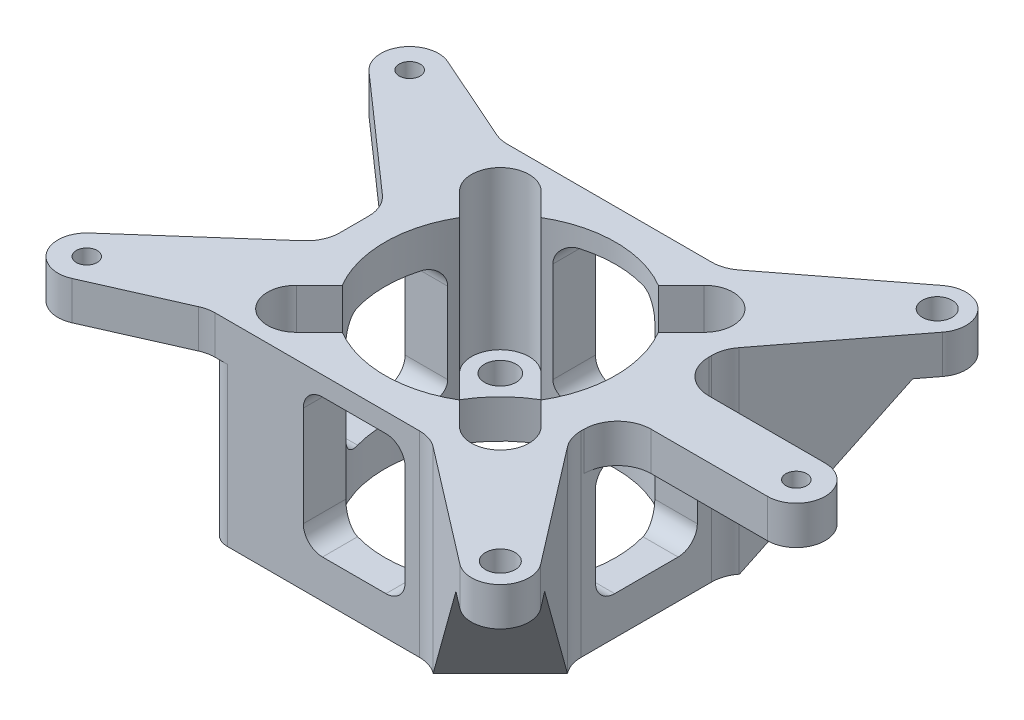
from build123d import *

# Parameters (mm, degrees)
SKETCH1_R                    = 19.0627
BOSS_EXTRUDE1_DEPTH          = 32.4104
F_5_0_2055_DIAMETER_HOLE1_D  = 5.2197
SKETCH8_W                    = 22.268051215
SKETCH8_H                    = 62.865
CUT_EXTRUDE3_DEPTH           = 26.0604
CUT_EXTRUDE6_DEPTH           = 75.820548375
CUT_EXTRUDE2_DEPTH           = 26.0604
CIRPATTERN1_COUNT            = 4
F_8_32_TAPPED_HOLE1_D        = 3.4544
F_10_0_1935_DIAMETER_HOLE1_D = 4.9149
FILLET2_R                    = 3.175
FILLET1_R                    = 5.55625
CUT_EXTRUDE4_DEPTH           = 91.286722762
CUT_EXTRUDE5_DEPTH           = 94.647649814


with BuildPart() as part:
    # Sketch1 → Boss-Extrude1 (new body)
    with BuildSketch(Plane(origin=(0, 0, 0), x_dir=(1, 0, 0), z_dir=(0, 1, 0))):
        with BuildLine():
            Line((39.863772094, 33.186200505), (24.13, 12.681549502))
            Line((24.13, 12.681549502), (24.13, 4.7625))
            Line((24.13, 4.7625), (48.895, 4.7625))
            ThreePointArc((48.895, 4.7625), (53.6575, 0), (48.895, -4.7625))
            Line((48.895, -4.7625), (24.13, -4.7625))
            Line((24.13, -4.7625), (24.13, -12.681549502))
            Line((24.13, -12.681549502), (39.863772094, -33.186200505))
            ThreePointArc((39.863772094, -33.186200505), (39.453022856, -39.453022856), (33.186200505, -39.863772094))
            Line((33.186200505, -39.863772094), (12.681549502, -24.13))
            Line((12.681549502, -24.13), (-24.13, -24.13))
            Line((-24.13, -24.13), (-39.707987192, -31.024986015))
            ThreePointArc((-39.707987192, -31.024986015), (-45.645851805, -29.23883153), (-44.78562033, -23.09809983))
            Line((-44.78562033, -23.09809983), (-24.13, -4.881848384))
            Line((-24.13, -4.881848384), (-24.13, 4.881848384))
            Line((-24.13, 4.881848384), (-44.78562033, 23.09809983))
            ThreePointArc((-44.78562033, 23.09809983), (-45.645851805, 29.23883153), (-39.707987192, 31.024986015))
            Line((-39.707987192, 31.024986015), (-24.13, 24.13))
            Line((-24.13, 24.13), (12.681549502, 24.13))
            Line((12.681549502, 24.13), (33.186200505, 39.863772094))
            ThreePointArc((33.186200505, 39.863772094), (39.453022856, 39.453022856), (39.863772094, 33.186200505))
        make_face()
        with Locations(Location((0, 0, 0), (0, 0, 270))):
            Circle(SKETCH1_R, mode=Mode.SUBTRACT)
    extrude(amount=BOSS_EXTRUDE1_DEPTH)

    # 5 _0.2055_ Diameter Hole1 (through all)
    with Locations(Plane(origin=(0, 32.4104, 0), x_dir=(1, 0, 0), z_dir=(0, 1, 0))):
        with Locations((-16.8402, -16.8402), (-16.8402, 16.8402), (16.8402, 16.8402), (16.8402, -16.8402)):
            Hole(F_5_0_2055_DIAMETER_HOLE1_D / 2)

    # Sketch8 → Cut-Extrude3 (cut)
    with BuildSketch(Plane.XZ):
        with Locations((-35.264025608, 0)):
            Rectangle(SKETCH8_W, SKETCH8_H)
        with BuildLine():
            Line((24.13, 4.7625), (24.13, -4.7625))
            Line((24.13, -4.7625), (48.895, -4.7625))
            ThreePointArc((48.895, -4.7625), (53.6575, 0), (48.895, 4.7625))
            Line((48.895, 4.7625), (24.13, 4.7625))
        make_face()
    extrude(amount=-CUT_EXTRUDE3_DEPTH, mode=Mode.SUBTRACT)

    # Sketch6 → Cut-Extrude6 (cut, symmetric)
    with BuildSketch(Plane(origin=(0, 0, 0), x_dir=(-0.7071067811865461, 0, -0.7071067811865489), z_dir=(0.7071067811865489, 0, -0.7071067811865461))):
        Polygon((-27.94, 0), (-48.175, 26.0604), (-55.795, 26.0604), (-55.795, 0), align=None)
    cut_extrude6 = extrude(amount=CUT_EXTRUDE6_DEPTH, both=True, mode=Mode.SUBTRACT)

    # Mirror1: Cut-Extrude6 across plane
    add(cut_extrude6.mirror(Plane.XY), mode=Mode.SUBTRACT)

    # Sketch7 → Cut-Extrude2 (cut)
    with BuildSketch(Plane(origin=(0, 32.4104, 0), x_dir=(1, 0, 0), z_dir=(0, 1, 0))):
        with BuildLine():
            Line((-20.207796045, 13.472603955), (-14.819642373, 8.084450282))
            Line((-14.819642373, 8.084450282), (-8.084450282, 14.819642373))
            Line((-8.084450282, 14.819642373), (-13.472603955, 20.207796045))
            ThreePointArc((-13.472603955, 20.207796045), (-20.207796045, 20.207796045), (-20.207796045, 13.472603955))
        make_face()
    cut_extrude2 = extrude(amount=-CUT_EXTRUDE2_DEPTH, mode=Mode.SUBTRACT)

    # CirPattern1: Cut-Extrude2 ×4 about axis
    cirpattern1_axis = Axis((0, 0, 0), (0, 1, 0))
    for i in range(1, CIRPATTERN1_COUNT):
        add(cut_extrude2.rotate(cirpattern1_axis, i * 360 / CIRPATTERN1_COUNT), mode=Mode.SUBTRACT)

    # 8-32 Tapped Hole1 (through all)
    with Locations(Plane(origin=(0, 32.4104, 0), x_dir=(1, 0, 0), z_dir=(0, 1, 0))):
        with Locations((-41.635551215, 26.67), (-41.635551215, -26.67), (48.895, 0)):
            Hole(F_8_32_TAPPED_HOLE1_D / 2)

    # 10 _0.1935_ Diameter Hole1 (through all)
    with Locations(Plane(origin=(0, 32.4104, 0), x_dir=(1, 0, 0), z_dir=(0, 1, 0))):
        with Locations((36.085426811, 36.085426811), (36.085426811, -36.085426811)):
            Hole(F_10_0_1935_DIAMETER_HOLE1_D / 2)

    # Fillet2
    fillet2_edges = [part.edges().sort_by_distance(p)[0] for p in [
        (-24.13, 13.0302, -24.13),
        (-24.13, 13.0302, 24.13),
    ]]
    fillet(fillet2_edges, radius=FILLET2_R)

    # Fillet1
    fillet1_edges = [part.edges().sort_by_distance(p)[0] for p in [
        (24.13, 29.2354, 4.7625),
        (24.13, 16.2052, 12.681549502),
        (12.681549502, 16.2052, 24.13),
        (-24.13, 29.2354, 24.13),
        (-24.13, 29.2354, 4.881848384),
        (-24.13, 29.2354, -4.881848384),
        (-24.13, 29.2354, -24.13),
        (12.681549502, 16.2052, -24.13),
        (24.13, 16.2052, -12.681549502),
        (24.13, 29.2354, -4.7625),
    ]]
    fillet(fillet1_edges, radius=FILLET1_R)

    # Sketch11 → Cut-Extrude4 (cut, through all)
    with BuildSketch(Plane.XY.offset(24.13)):
        with BuildLine():
            Line((5.239321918, 29.2354), (-5.239321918, 29.2354))
            ThreePointArc((-5.239321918, 29.2354), (-7.484385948, 28.30546403), (-8.414321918, 26.0604))
            Line((-8.414321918, 26.0604), (-8.414321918, 9.525))
            ThreePointArc((-8.414321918, 9.525), (-7.484385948, 7.27993597), (-5.239321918, 6.35))
            Line((-5.239321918, 6.35), (5.239321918, 6.35))
            ThreePointArc((5.239321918, 6.35), (7.484385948, 7.27993597), (8.414321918, 9.525))
            Line((8.414321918, 9.525), (8.414321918, 26.0604))
            ThreePointArc((8.414321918, 26.0604), (7.484385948, 28.30546403), (5.239321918, 29.2354))
        make_face()
    extrude(amount=-CUT_EXTRUDE4_DEPTH, mode=Mode.SUBTRACT)

    # Sketch12 → Cut-Extrude5 (cut, through all)
    with BuildSketch(Plane.ZY.offset(24.13)):
        with BuildLine():
            Line((-5.239321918, 6.35), (5.239321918, 6.35))
            ThreePointArc((5.239321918, 6.35), (7.484385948, 7.27993597), (8.414321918, 9.525))
            Line((8.414321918, 9.525), (8.414321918, 22.8854))
            ThreePointArc((8.414321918, 22.8854), (7.484385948, 25.13046403), (5.239321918, 26.0604))
            Line((5.239321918, 26.0604), (-5.239321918, 26.0604))
            ThreePointArc((-5.239321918, 26.0604), (-7.484385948, 25.13046403), (-8.414321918, 22.8854))
            Line((-8.414321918, 22.8854), (-8.414321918, 9.525))
            ThreePointArc((-8.414321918, 9.525), (-7.484385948, 7.27993597), (-5.239321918, 6.35))
        make_face()
    extrude(amount=-CUT_EXTRUDE5_DEPTH, mode=Mode.SUBTRACT)


solid = part.part
